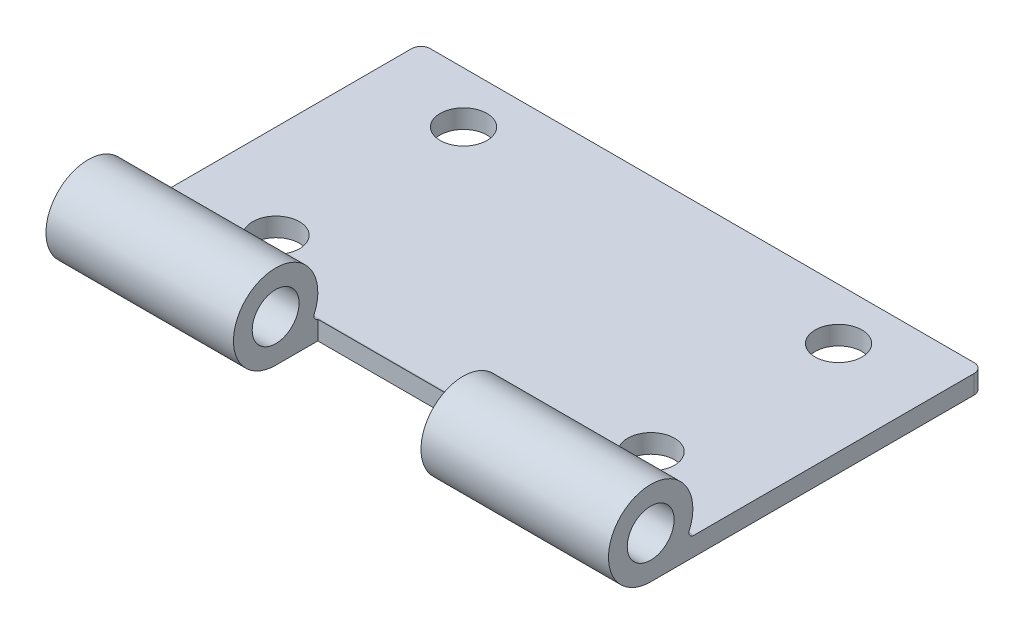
from build123d import *

# Parameters (mm, degrees)
SKETCH1_R           = 2.5
BOSS_EXTRUDE1_DEPTH = 60
SKETCH2_W           = 20
SKETCH2_H           = 9
CUT_EXTRUDE1_DEPTH  = 60
SKETCH3_R           = 2.5
CUT_EXTRUDE2_DEPTH  = 60
FILLET1_R           = 1


with BuildPart() as part:
    # Sketch1 → Boss-Extrude1 (new body)
    with BuildSketch(Plane(origin=(0, 0, 0), x_dir=(0, 0, -1), z_dir=(1, 0, 0))):
        with BuildLine():
            Line((4.048823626, 4.23802091), (-31.451176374, 4.23802091))
            ThreePointArc((-31.451176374, 4.23802091), (-33.915927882, 12.502991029), (-27.326858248, 6.93802091))
            ThreePointArc((-27.326858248, 6.93802091), (-27.286930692, 6.464159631), (-26.868600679, 6.23802091))
            Line((-26.868600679, 6.23802091), (4.048823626, 6.23802091))
            Line((4.048823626, 6.23802091), (4.048823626, 4.23802091))
        make_face()
        with Locations(Location((-31.451176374, 8.73802091, 0), (0, 0, 180))):
            Circle(SKETCH1_R, mode=Mode.SUBTRACT)
    extrude(amount=BOSS_EXTRUDE1_DEPTH)

    # Sketch2 → Cut-Extrude1 (cut)
    with BuildSketch(Plane(origin=(0, 0, 0), x_dir=(1, 0, 0), z_dir=(0, 1, 0))):
        with Locations((30, -31.451176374)):
            Rectangle(SKETCH2_W, SKETCH2_H)
    extrude(amount=CUT_EXTRUDE1_DEPTH, mode=Mode.SUBTRACT)

    # Sketch3 → Cut-Extrude2 (cut)
    with BuildSketch(Plane(origin=(0, 6.23802091, 0), x_dir=(1, 0, 0), z_dir=(0, 1, 0))):
        with Locations(Location((10, -1.409888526, 0), (0, 0, 270))):
            Circle(SKETCH3_R)
        with Locations(Location((10, -21.409888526, 0), (0, 0, 270))):
            Circle(SKETCH3_R)
        with Locations(Location((50, -21.409888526, 0), (0, 0, 270))):
            Circle(SKETCH3_R)
        with Locations(Location((50, -1.409888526, 0), (0, 0, 270))):
            Circle(SKETCH3_R)
    extrude(amount=-CUT_EXTRUDE2_DEPTH, mode=Mode.SUBTRACT)

    # Fillet1
    fillet1_edges = [part.edges().sort_by_distance(p)[0] for p in [
        (60, 5.23802091, -4.048823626),
        (0, 5.23802091, -4.048823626),
    ]]
    fillet(fillet1_edges, radius=FILLET1_R)


solid = part.part
